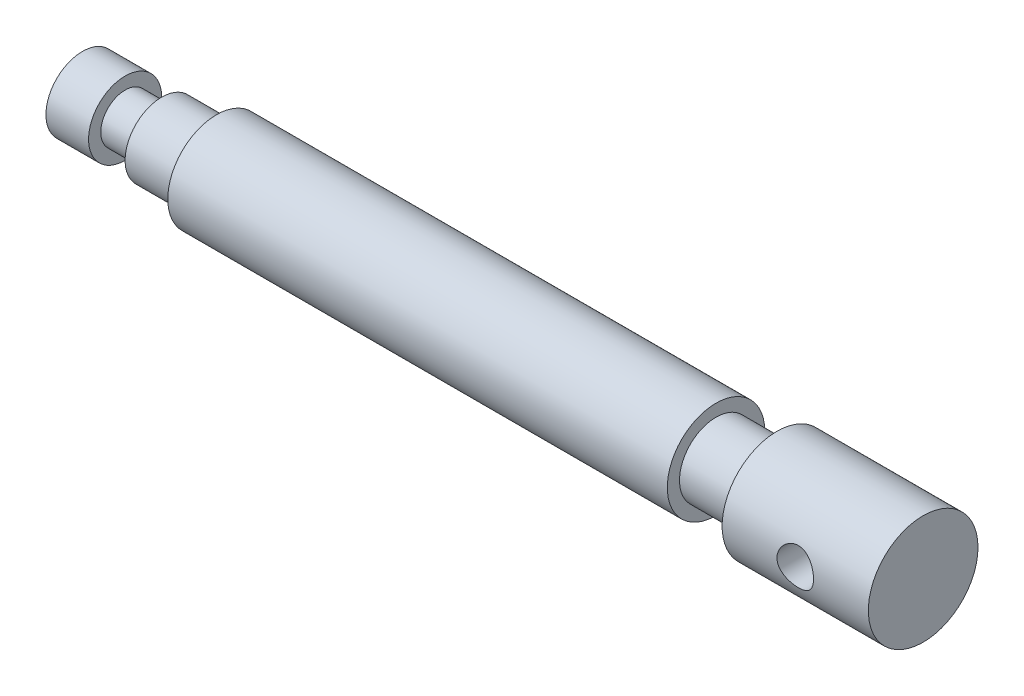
ISO-10303-21;
HEADER;
FILE_DESCRIPTION(('STEP AP214'),'2;1');
FILE_NAME('part.step','',(''),(''),'','','');
FILE_SCHEMA(('AUTOMOTIVE_DESIGN { 1 0 10303 214 1 1 1 1 }'));
ENDSEC;
DATA;
#1=APPLICATION_CONTEXT('core data for automotive mechanical design processes');
#2=APPLICATION_PROTOCOL_DEFINITION('international standard','automotive_design',2000,#1);
#3=PRODUCT_CONTEXT('',#1,'mechanical');
#4=PRODUCT('Part','Part','',(#3));
#5=PRODUCT_RELATED_PRODUCT_CATEGORY('part','',(#4));
#6=PRODUCT_DEFINITION_FORMATION('','',#4);
#7=PRODUCT_DEFINITION_CONTEXT('part definition',#1,'design');
#8=PRODUCT_DEFINITION('design','',#6,#7);
#9=PRODUCT_DEFINITION_SHAPE('','',#8);
#10=(LENGTH_UNIT() NAMED_UNIT(*) SI_UNIT(.MILLI.,.METRE.));
#11=(NAMED_UNIT(*) PLANE_ANGLE_UNIT() SI_UNIT($,.RADIAN.));
#12=(NAMED_UNIT(*) SI_UNIT($,.STERADIAN.) SOLID_ANGLE_UNIT());
#13=UNCERTAINTY_MEASURE_WITH_UNIT(LENGTH_MEASURE(1.E-05),#10,'distance_accuracy_value','');
#14=(GEOMETRIC_REPRESENTATION_CONTEXT(3) GLOBAL_UNCERTAINTY_ASSIGNED_CONTEXT((#13)) GLOBAL_UNIT_ASSIGNED_CONTEXT((#10,
#11,#12)) REPRESENTATION_CONTEXT('',''));
#15=CARTESIAN_POINT('',(0.,0.,0.));
#16=DIRECTION('',(0.,0.,1.));
#17=DIRECTION('',(1.,0.,0.));
#18=AXIS2_PLACEMENT_3D('',#15,#16,#17);
#19=CARTESIAN_POINT('',(0.,0.,0.));
#20=DIRECTION('',(-1.,0.,0.));
#21=DIRECTION('',(0.,0.,1.));
#22=AXIS2_PLACEMENT_3D('',#19,#20,#21);
#23=PLANE('',#22);
#24=CARTESIAN_POINT('',(0.,0.,0.));
#25=DIRECTION('',(1.,0.,0.));
#26=DIRECTION('',(0.,0.,-1.));
#27=AXIS2_PLACEMENT_3D('',#24,#25,#26);
#28=CIRCLE('',#27,6.);
#29=CARTESIAN_POINT('',(0.,0.,-6.));
#30=VERTEX_POINT('',#29);
#31=EDGE_CURVE('E10',#30,#30,#28,.T.);
#32=ORIENTED_EDGE('',*,*,#31,.F.);
#33=EDGE_LOOP('',(#32));
#34=FACE_BOUND('',#33,.T.);
#35=ADVANCED_FACE('F30',(#34),#23,.T.);
#36=CARTESIAN_POINT('',(0.,0.,0.));
#37=DIRECTION('',(1.,0.,0.));
#38=DIRECTION('',(0.,0.,-1.));
#39=AXIS2_PLACEMENT_3D('',#36,#37,#38);
#40=CYLINDRICAL_SURFACE('',#39,6.);
#41=ORIENTED_EDGE('',*,*,#31,.T.);
#42=EDGE_LOOP('',(#41));
#43=FACE_BOUND('',#42,.T.);
#44=CARTESIAN_POINT('',(7.,0.,0.));
#45=DIRECTION('',(1.,0.,0.));
#46=DIRECTION('',(0.,0.,-1.));
#47=AXIS2_PLACEMENT_3D('',#44,#45,#46);
#48=CIRCLE('',#47,6.);
#49=CARTESIAN_POINT('',(7.,0.,-6.));
#50=VERTEX_POINT('',#49);
#51=EDGE_CURVE('E42',#50,#50,#48,.T.);
#52=ORIENTED_EDGE('',*,*,#51,.F.);
#53=EDGE_LOOP('',(#52));
#54=FACE_BOUND('',#53,.T.);
#55=ADVANCED_FACE('F74',(#43,#54),#40,.T.);
#56=CARTESIAN_POINT('',(7.,6.,0.));
#57=DIRECTION('',(1.,0.,0.));
#58=DIRECTION('',(0.,0.,-1.));
#59=AXIS2_PLACEMENT_3D('',#56,#57,#58);
#60=PLANE('',#59);
#61=ORIENTED_EDGE('',*,*,#51,.T.);
#62=EDGE_LOOP('',(#61));
#63=FACE_BOUND('',#62,.T.);
#64=CARTESIAN_POINT('',(7.,0.,0.));
#65=DIRECTION('',(1.,0.,0.));
#66=DIRECTION('',(0.,0.,-1.));
#67=AXIS2_PLACEMENT_3D('',#64,#65,#66);
#68=CIRCLE('',#67,4.);
#69=CARTESIAN_POINT('',(7.,0.,-4.));
#70=VERTEX_POINT('',#69);
#71=EDGE_CURVE('E47',#70,#70,#68,.T.);
#72=ORIENTED_EDGE('',*,*,#71,.F.);
#73=EDGE_LOOP('',(#72));
#74=FACE_BOUND('',#73,.T.);
#75=ADVANCED_FACE('F79',(#63,#74),#60,.T.);
#76=CARTESIAN_POINT('',(0.,0.,0.));
#77=DIRECTION('',(1.,0.,0.));
#78=DIRECTION('',(0.,0.,-1.));
#79=AXIS2_PLACEMENT_3D('',#76,#77,#78);
#80=CYLINDRICAL_SURFACE('',#79,4.);
#81=ORIENTED_EDGE('',*,*,#71,.T.);
#82=EDGE_LOOP('',(#81));
#83=FACE_BOUND('',#82,.T.);
#84=CARTESIAN_POINT('',(13.,0.,0.));
#85=DIRECTION('',(1.,0.,0.));
#86=DIRECTION('',(0.,0.,-1.));
#87=AXIS2_PLACEMENT_3D('',#84,#85,#86);
#88=CIRCLE('',#87,4.);
#89=CARTESIAN_POINT('',(13.,0.,-4.));
#90=VERTEX_POINT('',#89);
#91=EDGE_CURVE('E146',#90,#90,#88,.T.);
#92=ORIENTED_EDGE('',*,*,#91,.F.);
#93=EDGE_LOOP('',(#92));
#94=FACE_BOUND('',#93,.T.);
#95=ADVANCED_FACE('F83',(#83,#94),#80,.T.);
#96=CARTESIAN_POINT('',(13.,4.,0.));
#97=DIRECTION('',(-1.,0.,0.));
#98=DIRECTION('',(0.,0.,1.));
#99=AXIS2_PLACEMENT_3D('',#96,#97,#98);
#100=PLANE('',#99);
#101=ORIENTED_EDGE('',*,*,#91,.T.);
#102=EDGE_LOOP('',(#101));
#103=FACE_BOUND('',#102,.T.);
#104=CARTESIAN_POINT('',(13.,0.,0.));
#105=DIRECTION('',(1.,0.,0.));
#106=DIRECTION('',(0.,0.,-1.));
#107=AXIS2_PLACEMENT_3D('',#104,#105,#106);
#108=CIRCLE('',#107,6.);
#109=CARTESIAN_POINT('',(13.,0.,-6.));
#110=VERTEX_POINT('',#109);
#111=EDGE_CURVE('E143',#110,#110,#108,.T.);
#112=ORIENTED_EDGE('',*,*,#111,.F.);
#113=EDGE_LOOP('',(#112));
#114=FACE_BOUND('',#113,.T.);
#115=ADVANCED_FACE('F90',(#103,#114),#100,.T.);
#116=CARTESIAN_POINT('',(0.,0.,0.));
#117=DIRECTION('',(1.,0.,0.));
#118=DIRECTION('',(0.,0.,-1.));
#119=AXIS2_PLACEMENT_3D('',#116,#117,#118);
#120=CYLINDRICAL_SURFACE('',#119,6.);
#121=ORIENTED_EDGE('',*,*,#111,.T.);
#122=EDGE_LOOP('',(#121));
#123=FACE_BOUND('',#122,.T.);
#124=CARTESIAN_POINT('',(22.,0.,0.));
#125=DIRECTION('',(1.,0.,0.));
#126=DIRECTION('',(0.,0.,-1.));
#127=AXIS2_PLACEMENT_3D('',#124,#125,#126);
#128=CIRCLE('',#127,6.);
#129=CARTESIAN_POINT('',(22.,0.,-6.));
#130=VERTEX_POINT('',#129);
#131=EDGE_CURVE('E140',#130,#130,#128,.T.);
#132=ORIENTED_EDGE('',*,*,#131,.F.);
#133=EDGE_LOOP('',(#132));
#134=FACE_BOUND('',#133,.T.);
#135=ADVANCED_FACE('F94',(#123,#134),#120,.T.);
#136=CARTESIAN_POINT('',(22.,6.,0.));
#137=DIRECTION('',(-1.,0.,0.));
#138=DIRECTION('',(0.,0.,1.));
#139=AXIS2_PLACEMENT_3D('',#136,#137,#138);
#140=PLANE('',#139);
#141=ORIENTED_EDGE('',*,*,#131,.T.);
#142=EDGE_LOOP('',(#141));
#143=FACE_BOUND('',#142,.T.);
#144=CARTESIAN_POINT('',(22.,0.,0.));
#145=DIRECTION('',(1.,0.,0.));
#146=DIRECTION('',(0.,0.,-1.));
#147=AXIS2_PLACEMENT_3D('',#144,#145,#146);
#148=CIRCLE('',#147,8.00000000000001);
#149=CARTESIAN_POINT('',(22.,0.,-8.00000000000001));
#150=VERTEX_POINT('',#149);
#151=EDGE_CURVE('E137',#150,#150,#148,.T.);
#152=ORIENTED_EDGE('',*,*,#151,.F.);
#153=EDGE_LOOP('',(#152));
#154=FACE_BOUND('',#153,.T.);
#155=ADVANCED_FACE('F98',(#143,#154),#140,.T.);
#156=CARTESIAN_POINT('',(0.,0.,0.));
#157=DIRECTION('',(1.,0.,0.));
#158=DIRECTION('',(0.,0.,-1.));
#159=AXIS2_PLACEMENT_3D('',#156,#157,#158);
#160=CYLINDRICAL_SURFACE('',#159,8.);
#161=ORIENTED_EDGE('',*,*,#151,.T.);
#162=EDGE_LOOP('',(#161));
#163=FACE_BOUND('',#162,.T.);
#164=CARTESIAN_POINT('',(104.,0.,0.));
#165=DIRECTION('',(1.,0.,0.));
#166=DIRECTION('',(0.,0.,-1.));
#167=AXIS2_PLACEMENT_3D('',#164,#165,#166);
#168=CIRCLE('',#167,8.);
#169=CARTESIAN_POINT('',(104.,0.,-8.));
#170=VERTEX_POINT('',#169);
#171=EDGE_CURVE('E134',#170,#170,#168,.T.);
#172=ORIENTED_EDGE('',*,*,#171,.F.);
#173=EDGE_LOOP('',(#172));
#174=FACE_BOUND('',#173,.T.);
#175=ADVANCED_FACE('F102',(#163,#174),#160,.T.);
#176=CARTESIAN_POINT('',(104.,8.,0.));
#177=DIRECTION('',(1.,0.,0.));
#178=DIRECTION('',(0.,0.,-1.));
#179=AXIS2_PLACEMENT_3D('',#176,#177,#178);
#180=PLANE('',#179);
#181=ORIENTED_EDGE('',*,*,#171,.T.);
#182=EDGE_LOOP('',(#181));
#183=FACE_BOUND('',#182,.T.);
#184=CARTESIAN_POINT('',(104.,0.,0.));
#185=DIRECTION('',(1.,0.,0.));
#186=DIRECTION('',(0.,0.,-1.));
#187=AXIS2_PLACEMENT_3D('',#184,#185,#186);
#188=CIRCLE('',#187,6.);
#189=CARTESIAN_POINT('',(104.,0.,-6.));
#190=VERTEX_POINT('',#189);
#191=EDGE_CURVE('E128',#190,#190,#188,.T.);
#192=ORIENTED_EDGE('',*,*,#191,.F.);
#193=EDGE_LOOP('',(#192));
#194=FACE_BOUND('',#193,.T.);
#195=ADVANCED_FACE('F106',(#183,#194),#180,.T.);
#196=CARTESIAN_POINT('',(0.,0.,0.));
#197=DIRECTION('',(1.,0.,0.));
#198=DIRECTION('',(0.,0.,-1.));
#199=AXIS2_PLACEMENT_3D('',#196,#197,#198);
#200=CYLINDRICAL_SURFACE('',#199,6.);
#201=ORIENTED_EDGE('',*,*,#191,.T.);
#202=EDGE_LOOP('',(#201));
#203=FACE_BOUND('',#202,.T.);
#204=CARTESIAN_POINT('',(114.,0.,0.));
#205=DIRECTION('',(1.,0.,0.));
#206=DIRECTION('',(0.,0.,-1.));
#207=AXIS2_PLACEMENT_3D('',#204,#205,#206);
#208=CIRCLE('',#207,6.);
#209=CARTESIAN_POINT('',(114.,0.,-6.));
#210=VERTEX_POINT('',#209);
#211=EDGE_CURVE('E121',#210,#210,#208,.T.);
#212=ORIENTED_EDGE('',*,*,#211,.F.);
#213=EDGE_LOOP('',(#212));
#214=FACE_BOUND('',#213,.T.);
#215=ADVANCED_FACE('F110',(#203,#214),#200,.T.);
#216=CARTESIAN_POINT('',(114.,6.,0.));
#217=DIRECTION('',(-1.,0.,0.));
#218=DIRECTION('',(0.,0.,1.));
#219=AXIS2_PLACEMENT_3D('',#216,#217,#218);
#220=PLANE('',#219);
#221=ORIENTED_EDGE('',*,*,#211,.T.);
#222=EDGE_LOOP('',(#221));
#223=FACE_BOUND('',#222,.T.);
#224=CARTESIAN_POINT('',(114.,0.,0.));
#225=DIRECTION('',(1.,0.,0.));
#226=DIRECTION('',(0.,0.,-1.));
#227=AXIS2_PLACEMENT_3D('',#224,#225,#226);
#228=CIRCLE('',#227,9.00000000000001);
#229=CARTESIAN_POINT('',(114.,0.,-9.00000000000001));
#230=VERTEX_POINT('',#229);
#231=EDGE_CURVE('E124',#230,#230,#228,.T.);
#232=ORIENTED_EDGE('',*,*,#231,.F.);
#233=EDGE_LOOP('',(#232));
#234=FACE_BOUND('',#233,.T.);
#235=ADVANCED_FACE('F70',(#223,#234),#220,.T.);
#236=CARTESIAN_POINT('',(0.,0.,0.));
#237=DIRECTION('',(1.,0.,0.));
#238=DIRECTION('',(0.,0.,-1.));
#239=AXIS2_PLACEMENT_3D('',#236,#237,#238);
#240=CYLINDRICAL_SURFACE('',#239,9.00000000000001);
#241=CARTESIAN_POINT('',(123.,0.,-9.00000000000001));
#242=CARTESIAN_POINT('',(122.999999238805,0.16369008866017,-9.00000045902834));
#243=CARTESIAN_POINT('',(123.013440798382,0.327375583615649,-8.99549308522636));
#244=CARTESIAN_POINT('',(123.066687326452,0.649925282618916,-8.97795630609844));
#245=CARTESIAN_POINT('',(123.106495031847,0.808788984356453,-8.96492601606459));
#246=CARTESIAN_POINT('',(123.210957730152,1.11699836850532,-8.93175923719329));
#247=CARTESIAN_POINT('',(123.275571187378,1.2663594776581,-8.91163463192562));
#248=CARTESIAN_POINT('',(123.427623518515,1.55212481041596,-8.86633337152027));
#249=CARTESIAN_POINT('',(123.515066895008,1.68852647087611,-8.84115572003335));
#250=CARTESIAN_POINT('',(123.713477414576,1.94922502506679,-8.78742283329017));
#251=CARTESIAN_POINT('',(123.825093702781,2.07301110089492,-8.75878669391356));
#252=CARTESIAN_POINT('',(124.06730146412,2.30049807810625,-8.70180944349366));
#253=CARTESIAN_POINT('',(124.197897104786,2.40419455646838,-8.67346839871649));
#254=CARTESIAN_POINT('',(124.478955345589,2.59147482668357,-8.61939997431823));
#255=CARTESIAN_POINT('',(124.629881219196,2.67439457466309,-8.59377117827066));
#256=CARTESIAN_POINT('',(124.944528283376,2.81345662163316,-8.54925916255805));
#257=CARTESIAN_POINT('',(125.108245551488,2.86960709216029,-8.53037388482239));
#258=CARTESIAN_POINT('',(125.43801966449,2.95162038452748,-8.50233909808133));
#259=CARTESIAN_POINT('',(125.603811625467,2.9784403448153,-8.49288287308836));
#260=CARTESIAN_POINT('',(125.937791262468,3.00402337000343,-8.48386969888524));
#261=CARTESIAN_POINT('',(126.105978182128,3.00279510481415,-8.48430969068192));
#262=CARTESIAN_POINT('',(126.431809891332,2.97305971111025,-8.49477045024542));
#263=CARTESIAN_POINT('',(126.589585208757,2.94580173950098,-8.50435247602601));
#264=CARTESIAN_POINT('',(126.898180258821,2.86681848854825,-8.53129973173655));
#265=CARTESIAN_POINT('',(127.048999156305,2.81509027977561,-8.54866589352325));
#266=CARTESIAN_POINT('',(127.342238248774,2.68781717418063,-8.58953733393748));
#267=CARTESIAN_POINT('',(127.484484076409,2.61190214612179,-8.61313697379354));
#268=CARTESIAN_POINT('',(127.754612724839,2.43866731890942,-8.6637767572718));
#269=CARTESIAN_POINT('',(127.8824913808,2.34134133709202,-8.69081789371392));
#270=CARTESIAN_POINT('',(128.127274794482,2.12204799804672,-8.74701987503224));
#271=CARTESIAN_POINT('',(128.243258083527,1.99905945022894,-8.7762176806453));
#272=CARTESIAN_POINT('',(128.45319379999,1.73501870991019,-8.83220815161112));
#273=CARTESIAN_POINT('',(128.547144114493,1.59396478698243,-8.85900058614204));
#274=CARTESIAN_POINT('',(128.711088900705,1.29584283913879,-8.90751323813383));
#275=CARTESIAN_POINT('',(128.780836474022,1.138629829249,-8.92918050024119));
#276=CARTESIAN_POINT('',(128.892609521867,0.813807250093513,-8.96461701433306));
#277=CARTESIAN_POINT('',(128.93464462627,0.646201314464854,-8.97838900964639));
#278=CARTESIAN_POINT('',(128.988166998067,0.313151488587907,-8.99602881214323));
#279=CARTESIAN_POINT('',(129.000899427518,0.147928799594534,-9.00030005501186));
#280=CARTESIAN_POINT('',(128.999001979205,-0.182325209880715,-8.99966708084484));
#281=CARTESIAN_POINT('',(128.98437672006,-0.347356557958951,-8.99476441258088));
#282=CARTESIAN_POINT('',(128.929164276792,-0.667559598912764,-8.97660074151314));
#283=CARTESIAN_POINT('',(128.889341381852,-0.822878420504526,-8.96358596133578));
#284=CARTESIAN_POINT('',(128.7858196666,-1.12456787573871,-8.93075540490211));
#285=CARTESIAN_POINT('',(128.722117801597,-1.27093736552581,-8.91093876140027));
#286=CARTESIAN_POINT('',(128.570788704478,-1.55486488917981,-8.86586793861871));
#287=CARTESIAN_POINT('',(128.48257622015,-1.69208987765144,-8.8404844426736));
#288=CARTESIAN_POINT('',(128.28541754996,-1.95019449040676,-8.78715761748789));
#289=CARTESIAN_POINT('',(128.176465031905,-2.07106910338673,-8.75921350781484));
#290=CARTESIAN_POINT('',(127.93506374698,-2.29875752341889,-8.70230543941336));
#291=CARTESIAN_POINT('',(127.801772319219,-2.40468290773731,-8.67335283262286));
#292=CARTESIAN_POINT('',(127.518685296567,-2.59277256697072,-8.61899919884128));
#293=CARTESIAN_POINT('',(127.368889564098,-2.67493664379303,-8.59359820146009));
#294=CARTESIAN_POINT('',(127.05698095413,-2.81279079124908,-8.54947175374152));
#295=CARTESIAN_POINT('',(126.894893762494,-2.86853439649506,-8.53073282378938));
#296=CARTESIAN_POINT('',(126.562864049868,-2.95168400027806,-8.5023249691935));
#297=CARTESIAN_POINT('',(126.392925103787,-2.97910276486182,-8.4926519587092));
#298=CARTESIAN_POINT('',(126.059408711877,-3.00382884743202,-8.48393576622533));
#299=CARTESIAN_POINT('',(125.89595297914,-3.00261077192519,-8.48437200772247));
#300=CARTESIAN_POINT('',(125.571704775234,-2.97372688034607,-8.49453809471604));
#301=CARTESIAN_POINT('',(125.410912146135,-2.94606263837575,-8.50426738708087));
#302=CARTESIAN_POINT('',(125.099593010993,-2.86611543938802,-8.53153572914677));
#303=CARTESIAN_POINT('',(124.948929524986,-2.81431003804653,-8.54892294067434));
#304=CARTESIAN_POINT('',(124.658317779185,-2.68793809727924,-8.58949196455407));
#305=CARTESIAN_POINT('',(124.518371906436,-2.61336650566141,-8.61267506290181));
#306=CARTESIAN_POINT('',(124.246548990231,-2.43978207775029,-8.6634848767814));
#307=CARTESIAN_POINT('',(124.115290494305,-2.33984472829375,-8.69126134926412));
#308=CARTESIAN_POINT('',(123.870930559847,-2.11992864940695,-8.7475006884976));
#309=CARTESIAN_POINT('',(123.757834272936,-1.99994425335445,-8.77596374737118));
#310=CARTESIAN_POINT('',(123.548566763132,-1.73772467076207,-8.83170091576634));
#311=CARTESIAN_POINT('',(123.453226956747,-1.59480454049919,-8.85888545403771));
#312=CARTESIAN_POINT('',(123.288028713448,-1.29407207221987,-8.90777973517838));
#313=CARTESIAN_POINT('',(123.218163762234,-1.13626355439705,-8.92949087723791));
#314=CARTESIAN_POINT('',(123.108835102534,-0.81748094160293,-8.96416545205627));
#315=CARTESIAN_POINT('',(123.06815260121,-0.65696327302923,-8.97747637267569));
#316=CARTESIAN_POINT('',(123.013739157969,-0.330961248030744,-8.99539221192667));
#317=CARTESIAN_POINT('',(123.00000076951,-0.16547827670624,-8.99999953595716));
#318=CARTESIAN_POINT('',(123.,0.,-9.00000000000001));
#319=B_SPLINE_CURVE_WITH_KNOTS('',3,(#241,#242,#243,#244,#245,#246,#247,#248,#249,#250,#251,
#252,#253,#254,#255,#256,#257,#258,#259,#260,#261,#262,#263,#264,#265,#266,#267,#268,#269,#270,
#271,#272,#273,#274,#275,#276,#277,#278,#279,#280,#281,#282,#283,#284,#285,#286,#287,#288,#289,
#290,#291,#292,#293,#294,#295,#296,#297,#298,#299,#300,#301,#302,#303,#304,#305,#306,#307,#308,
#309,#310,#311,#312,#313,#314,#315,#316,#317,#318),.UNSPECIFIED.,.T.,.F.,(4,2,2,2,2,2,2,2,2,2,2,
2,2,2,2,2,2,2,2,2,2,2,2,2,2,2,2,2,2,2,2,2,2,2,2,2,2,2,4),(0.,0.490461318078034,
0.980973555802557,1.47066801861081,1.96045913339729,2.46554052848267,2.9707329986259,
3.4904515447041,4.01001134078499,4.51205777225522,5.01394901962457,5.49290479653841,
5.97191792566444,6.4586451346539,6.94551307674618,7.45779917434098,7.97013437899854,
8.48755216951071,9.00479006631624,9.49960749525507,9.99434139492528,10.4747447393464,
10.9552093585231,11.4483119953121,11.9415654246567,12.4572306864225,12.9729002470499,
13.4875204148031,14.0019085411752,14.4898699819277,14.9778023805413,15.4564676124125,
15.9352391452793,16.4349020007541,16.9347063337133,17.453989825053,17.9731404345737,
18.4690967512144,18.9649159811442),.UNSPECIFIED.);
#320=CARTESIAN_POINT('',(123.,0.,-9.00000000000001));
#321=VERTEX_POINT('',#320);
#322=EDGE_CURVE('E33',#321,#321,#319,.T.);
#323=ORIENTED_EDGE('',*,*,#322,.F.);
#324=EDGE_LOOP('',(#323));
#325=FACE_BOUND('',#324,.T.);
#326=CARTESIAN_POINT('',(129.,0.,9.00000000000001));
#327=CARTESIAN_POINT('',(129.000000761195,0.163690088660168,9.00000045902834));
#328=CARTESIAN_POINT('',(128.986559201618,0.327375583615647,8.99549308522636));
#329=CARTESIAN_POINT('',(128.933312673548,0.649925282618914,8.97795630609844));
#330=CARTESIAN_POINT('',(128.893504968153,0.808788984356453,8.96492601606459));
#331=CARTESIAN_POINT('',(128.789042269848,1.11699836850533,8.93175923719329));
#332=CARTESIAN_POINT('',(128.724428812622,1.26635947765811,8.91163463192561));
#333=CARTESIAN_POINT('',(128.572376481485,1.55212481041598,8.86633337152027));
#334=CARTESIAN_POINT('',(128.484933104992,1.68852647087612,8.84115572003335));
#335=CARTESIAN_POINT('',(128.286522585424,1.94922502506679,8.78742283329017));
#336=CARTESIAN_POINT('',(128.174906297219,2.07301110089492,8.75878669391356));
#337=CARTESIAN_POINT('',(127.93269853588,2.30049807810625,8.70180944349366));
#338=CARTESIAN_POINT('',(127.802102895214,2.40419455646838,8.67346839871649));
#339=CARTESIAN_POINT('',(127.521044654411,2.59147482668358,8.61939997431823));
#340=CARTESIAN_POINT('',(127.370118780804,2.6743945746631,8.59377117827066));
#341=CARTESIAN_POINT('',(127.055471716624,2.81345662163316,8.54925916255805));
#342=CARTESIAN_POINT('',(126.891754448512,2.86960709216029,8.53037388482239));
#343=CARTESIAN_POINT('',(126.56198033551,2.95162038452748,8.50233909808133));
#344=CARTESIAN_POINT('',(126.396188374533,2.9784403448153,8.49288287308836));
#345=CARTESIAN_POINT('',(126.062208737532,3.00402337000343,8.48386969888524));
#346=CARTESIAN_POINT('',(125.894021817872,3.00279510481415,8.48430969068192));
#347=CARTESIAN_POINT('',(125.568190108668,2.97305971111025,8.49477045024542));
#348=CARTESIAN_POINT('',(125.410414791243,2.94580173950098,8.50435247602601));
#349=CARTESIAN_POINT('',(125.101819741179,2.86681848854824,8.53129973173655));
#350=CARTESIAN_POINT('',(124.951000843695,2.8150902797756,8.54866589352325));
#351=CARTESIAN_POINT('',(124.657761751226,2.68781717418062,8.58953733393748));
#352=CARTESIAN_POINT('',(124.515515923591,2.61190214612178,8.61313697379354));
#353=CARTESIAN_POINT('',(124.245387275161,2.43866731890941,8.66377675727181));
#354=CARTESIAN_POINT('',(124.1175086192,2.34134133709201,8.69081789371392));
#355=CARTESIAN_POINT('',(123.872725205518,2.1220479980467,8.74701987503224));
#356=CARTESIAN_POINT('',(123.756741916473,1.99905945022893,8.7762176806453));
#357=CARTESIAN_POINT('',(123.54680620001,1.73501870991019,8.83220815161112));
#358=CARTESIAN_POINT('',(123.452855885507,1.59396478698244,8.85900058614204));
#359=CARTESIAN_POINT('',(123.288911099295,1.2958428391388,8.90751323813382));
#360=CARTESIAN_POINT('',(123.219163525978,1.138629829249,8.92918050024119));
#361=CARTESIAN_POINT('',(123.107390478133,0.813807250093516,8.96461701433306));
#362=CARTESIAN_POINT('',(123.06535537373,0.646201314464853,8.97838900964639));
#363=CARTESIAN_POINT('',(123.011833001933,0.313151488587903,8.99602881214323));
#364=CARTESIAN_POINT('',(122.999100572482,0.147928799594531,9.00030005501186));
#365=CARTESIAN_POINT('',(123.000998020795,-0.182325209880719,8.99966708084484));
#366=CARTESIAN_POINT('',(123.01562327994,-0.347356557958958,8.99476441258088));
#367=CARTESIAN_POINT('',(123.070835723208,-0.667559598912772,8.97660074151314));
#368=CARTESIAN_POINT('',(123.110658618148,-0.822878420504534,8.96358596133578));
#369=CARTESIAN_POINT('',(123.2141803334,-1.12456787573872,8.93075540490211));
#370=CARTESIAN_POINT('',(123.277882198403,-1.27093736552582,8.91093876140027));
#371=CARTESIAN_POINT('',(123.429211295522,-1.55486488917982,8.86586793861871));
#372=CARTESIAN_POINT('',(123.51742377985,-1.69208987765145,8.8404844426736));
#373=CARTESIAN_POINT('',(123.71458245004,-1.95019449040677,8.78715761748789));
#374=CARTESIAN_POINT('',(123.823534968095,-2.07106910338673,8.75921350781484));
#375=CARTESIAN_POINT('',(124.06493625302,-2.2987575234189,8.70230543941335));
#376=CARTESIAN_POINT('',(124.198227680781,-2.40468290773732,8.67335283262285));
#377=CARTESIAN_POINT('',(124.481314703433,-2.59277256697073,8.61899919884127));
#378=CARTESIAN_POINT('',(124.631110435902,-2.67493664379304,8.59359820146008));
#379=CARTESIAN_POINT('',(124.94301904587,-2.81279079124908,8.54947175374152));
#380=CARTESIAN_POINT('',(125.105106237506,-2.86853439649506,8.53073282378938));
#381=CARTESIAN_POINT('',(125.437135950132,-2.95168400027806,8.5023249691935));
#382=CARTESIAN_POINT('',(125.607074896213,-2.97910276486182,8.4926519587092));
#383=CARTESIAN_POINT('',(125.940591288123,-3.00382884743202,8.48393576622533));
#384=CARTESIAN_POINT('',(126.10404702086,-3.00261077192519,8.48437200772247));
#385=CARTESIAN_POINT('',(126.428295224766,-2.97372688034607,8.49453809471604));
#386=CARTESIAN_POINT('',(126.589087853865,-2.94606263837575,8.50426738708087));
#387=CARTESIAN_POINT('',(126.900406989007,-2.86611543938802,8.53153572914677));
#388=CARTESIAN_POINT('',(127.051070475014,-2.81431003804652,8.54892294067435));
#389=CARTESIAN_POINT('',(127.341682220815,-2.68793809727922,8.58949196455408));
#390=CARTESIAN_POINT('',(127.481628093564,-2.6133665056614,8.61267506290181));
#391=CARTESIAN_POINT('',(127.753451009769,-2.43978207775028,8.66348487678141));
#392=CARTESIAN_POINT('',(127.884709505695,-2.33984472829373,8.69126134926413));
#393=CARTESIAN_POINT('',(128.129069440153,-2.11992864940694,8.7475006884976));
#394=CARTESIAN_POINT('',(128.242165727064,-1.99994425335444,8.77596374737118));
#395=CARTESIAN_POINT('',(128.451433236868,-1.73772467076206,8.83170091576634));
#396=CARTESIAN_POINT('',(128.546773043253,-1.59480454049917,8.85888545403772));
#397=CARTESIAN_POINT('',(128.711971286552,-1.29407207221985,8.90777973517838));
#398=CARTESIAN_POINT('',(128.781836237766,-1.13626355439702,8.92949087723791));
#399=CARTESIAN_POINT('',(128.891164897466,-0.817480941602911,8.96416545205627));
#400=CARTESIAN_POINT('',(128.93184739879,-0.656963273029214,8.9774763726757));
#401=CARTESIAN_POINT('',(128.986260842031,-0.330961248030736,8.99539221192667));
#402=CARTESIAN_POINT('',(128.99999923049,-0.165478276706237,8.99999953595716));
#403=CARTESIAN_POINT('',(129.,0.,9.00000000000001));
#404=B_SPLINE_CURVE_WITH_KNOTS('',3,(#326,#327,#328,#329,#330,#331,#332,#333,#334,#335,#336,
#337,#338,#339,#340,#341,#342,#343,#344,#345,#346,#347,#348,#349,#350,#351,#352,#353,#354,#355,
#356,#357,#358,#359,#360,#361,#362,#363,#364,#365,#366,#367,#368,#369,#370,#371,#372,#373,#374,
#375,#376,#377,#378,#379,#380,#381,#382,#383,#384,#385,#386,#387,#388,#389,#390,#391,#392,#393,
#394,#395,#396,#397,#398,#399,#400,#401,#402,#403),.UNSPECIFIED.,.T.,.F.,(4,2,2,2,2,2,2,2,2,2,2,
2,2,2,2,2,2,2,2,2,2,2,2,2,2,2,2,2,2,2,2,2,2,2,2,2,2,2,4),(0.,0.490461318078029,
0.980973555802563,1.47066801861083,1.96045913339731,2.46554052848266,2.97073299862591,
3.49045154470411,4.01001134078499,4.51205777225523,5.01394901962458,5.49290479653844,
5.97191792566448,6.45864513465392,6.94551307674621,7.457799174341,7.97013437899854,
8.48755216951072,9.00479006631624,9.49960749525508,9.99434139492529,10.4747447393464,
10.9552093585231,11.4483119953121,11.9415654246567,12.4572306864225,12.9729002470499,
13.4875204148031,14.0019085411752,14.4898699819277,14.9778023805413,15.4564676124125,
15.9352391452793,16.4349020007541,16.9347063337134,17.453989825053,17.9731404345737,
18.4690967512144,18.9649159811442),.UNSPECIFIED.);
#405=CARTESIAN_POINT('',(129.,0.,9.00000000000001));
#406=VERTEX_POINT('',#405);
#407=EDGE_CURVE('E50',#406,#406,#404,.T.);
#408=ORIENTED_EDGE('',*,*,#407,.F.);
#409=EDGE_LOOP('',(#408));
#410=FACE_BOUND('',#409,.T.);
#411=ORIENTED_EDGE('',*,*,#231,.T.);
#412=EDGE_LOOP('',(#411));
#413=FACE_BOUND('',#412,.T.);
#414=CARTESIAN_POINT('',(138.,0.,0.));
#415=DIRECTION('',(1.,0.,0.));
#416=DIRECTION('',(0.,0.,-1.));
#417=AXIS2_PLACEMENT_3D('',#414,#415,#416);
#418=CIRCLE('',#417,9.00000000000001);
#419=CARTESIAN_POINT('',(138.,0.,-9.00000000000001));
#420=VERTEX_POINT('',#419);
#421=EDGE_CURVE('E126',#420,#420,#418,.T.);
#422=ORIENTED_EDGE('',*,*,#421,.F.);
#423=EDGE_LOOP('',(#422));
#424=FACE_BOUND('',#423,.T.);
#425=ADVANCED_FACE('F55',(#325,#410,#413,#424),#240,.T.);
#426=CARTESIAN_POINT('',(138.,9.00000000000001,0.));
#427=DIRECTION('',(1.,0.,0.));
#428=DIRECTION('',(0.,0.,-1.));
#429=AXIS2_PLACEMENT_3D('',#426,#427,#428);
#430=PLANE('',#429);
#431=ORIENTED_EDGE('',*,*,#421,.T.);
#432=EDGE_LOOP('',(#431));
#433=FACE_BOUND('',#432,.T.);
#434=ADVANCED_FACE('F62',(#433),#430,.T.);
#435=CARTESIAN_POINT('',(126.,0.,-10.));
#436=DIRECTION('',(0.,0.,1.));
#437=DIRECTION('',(1.,0.,0.));
#438=AXIS2_PLACEMENT_3D('',#435,#436,#437);
#439=CYLINDRICAL_SURFACE('',#438,2.99999999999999);
#440=ORIENTED_EDGE('',*,*,#322,.T.);
#441=EDGE_LOOP('',(#440));
#442=FACE_BOUND('',#441,.T.);
#443=ORIENTED_EDGE('',*,*,#407,.T.);
#444=EDGE_LOOP('',(#443));
#445=FACE_BOUND('',#444,.T.);
#446=ADVANCED_FACE('F59',(#442,#445),#439,.F.);
#447=CLOSED_SHELL('',(#35,#55,#75,#95,#115,#135,#155,#175,#195,#215,#235,#425,#434,#446));
#448=MANIFOLD_SOLID_BREP('B2',#447);
#449=ADVANCED_BREP_SHAPE_REPRESENTATION('',(#18,#448),#14);
#450=SHAPE_DEFINITION_REPRESENTATION(#9,#449);
ENDSEC;
END-ISO-10303-21;
